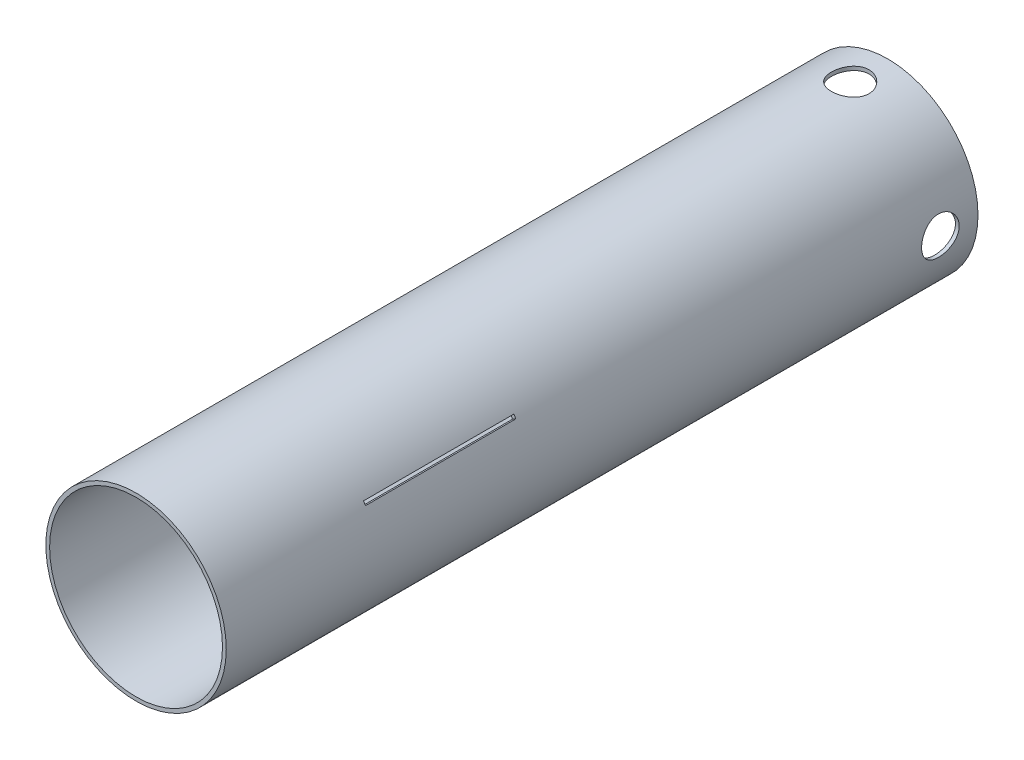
from build123d import *

# Parameters (mm, degrees)
ESQUISSE1_R                  = 240
ESQUISSE1_R_2                = 230
BOSS_EXTRU_1_DEPTH           = 2000
ESQUISSE2_R                  = 50
ENL_V_MAT_EXTRU_1_DEPTH      = 2029.595573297
R_P_TITION_CIRCULAIRE1_COUNT = 4
ESQUISSE3_W                  = 10
ESQUISSE3_H                  = 400
ENL_V_MAT_EXTRU_2_DEPTH      = 2029.59557342
R_P_TITION_CIRCULAIRE2_COUNT = 3


with BuildPart() as part:
    # Esquisse1 → Boss.-Extru.1 (new body)
    with BuildSketch(Plane.XY):
        Circle(ESQUISSE1_R)
        Circle(ESQUISSE1_R_2, mode=Mode.SUBTRACT)
    extrude(amount=BOSS_EXTRU_1_DEPTH)

    # Esquisse2 → Enl_v. mat.-Extru.1 (cut, through all)
    with BuildSketch(Plane(origin=(0, 0, 0), x_dir=(1, 0, 0), z_dir=(0, 1, 0))):
        with Locations(Location((0, -100, 0), (0, 0, 270))):
            Circle(ESQUISSE2_R)
    enl_v_mat_extru_1 = extrude(amount=-ENL_V_MAT_EXTRU_1_DEPTH, mode=Mode.SUBTRACT)

    # R_p_tition circulaire1: Enl_v. mat.-Extru.1 ×4 about axis
    r_p_tition_circulaire1_axis = Axis((0, 0, 2000), (0, 0, -1))
    for i in range(1, R_P_TITION_CIRCULAIRE1_COUNT):
        add(enl_v_mat_extru_1.rotate(r_p_tition_circulaire1_axis, i * 360 / R_P_TITION_CIRCULAIRE1_COUNT), mode=Mode.SUBTRACT)

    # Esquisse3 → Enl_v. mat.-Extru.2 (cut, through all)
    with BuildSketch(Plane(origin=(0, 0, 0), x_dir=(1, 0, 0), z_dir=(0, 1, 0))):
        with Locations((0, -1400)):
            Rectangle(ESQUISSE3_W, ESQUISSE3_H)
    enl_v_mat_extru_2 = extrude(amount=-ENL_V_MAT_EXTRU_2_DEPTH, mode=Mode.SUBTRACT)

    # R_p_tition circulaire2: Enl_v. mat.-Extru.2 ×3 about axis
    r_p_tition_circulaire2_axis = Axis((0, 0, 0), (0, 0, 1))
    for i in range(1, R_P_TITION_CIRCULAIRE2_COUNT):
        add(enl_v_mat_extru_2.rotate(r_p_tition_circulaire2_axis, i * 360 / R_P_TITION_CIRCULAIRE2_COUNT), mode=Mode.SUBTRACT)


solid = part.part
